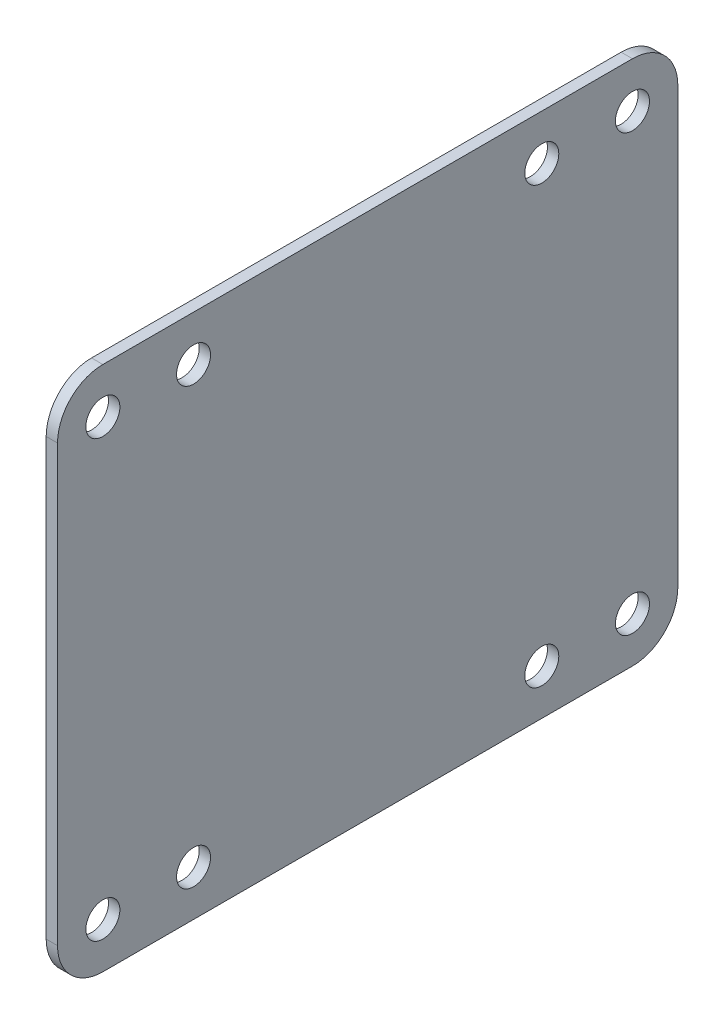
ISO-10303-21;
HEADER;
FILE_DESCRIPTION(('STEP AP214'),'2;1');
FILE_NAME('part.step','',(''),(''),'','','');
FILE_SCHEMA(('AUTOMOTIVE_DESIGN { 1 0 10303 214 1 1 1 1 }'));
ENDSEC;
DATA;
#1=APPLICATION_CONTEXT('core data for automotive mechanical design processes');
#2=APPLICATION_PROTOCOL_DEFINITION('international standard','automotive_design',2000,#1);
#3=PRODUCT_CONTEXT('',#1,'mechanical');
#4=PRODUCT('Part','Part','',(#3));
#5=PRODUCT_RELATED_PRODUCT_CATEGORY('part','',(#4));
#6=PRODUCT_DEFINITION_FORMATION('','',#4);
#7=PRODUCT_DEFINITION_CONTEXT('part definition',#1,'design');
#8=PRODUCT_DEFINITION('design','',#6,#7);
#9=PRODUCT_DEFINITION_SHAPE('','',#8);
#10=(LENGTH_UNIT() NAMED_UNIT(*) SI_UNIT(.MILLI.,.METRE.));
#11=(NAMED_UNIT(*) PLANE_ANGLE_UNIT() SI_UNIT($,.RADIAN.));
#12=(NAMED_UNIT(*) SI_UNIT($,.STERADIAN.) SOLID_ANGLE_UNIT());
#13=UNCERTAINTY_MEASURE_WITH_UNIT(LENGTH_MEASURE(1.E-05),#10,'distance_accuracy_value','');
#14=(GEOMETRIC_REPRESENTATION_CONTEXT(3) GLOBAL_UNCERTAINTY_ASSIGNED_CONTEXT((#13)) GLOBAL_UNIT_ASSIGNED_CONTEXT((#10,
#11,#12)) REPRESENTATION_CONTEXT('',''));
#15=CARTESIAN_POINT('',(0.,0.,0.));
#16=DIRECTION('',(0.,0.,1.));
#17=DIRECTION('',(1.,0.,0.));
#18=AXIS2_PLACEMENT_3D('',#15,#16,#17);
#19=CARTESIAN_POINT('',(1.5875,0.,0.));
#20=DIRECTION('',(1.,0.,0.));
#21=DIRECTION('',(0.,0.,-1.));
#22=AXIS2_PLACEMENT_3D('',#19,#20,#21);
#23=PLANE('',#22);
#24=CARTESIAN_POINT('',(1.5875,-60.96,-61.468));
#25=DIRECTION('',(1.,0.,0.));
#26=DIRECTION('',(0.,0.,-1.));
#27=AXIS2_PLACEMENT_3D('',#24,#25,#26);
#28=CIRCLE('',#27,2.38125000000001);
#29=CARTESIAN_POINT('',(1.5875,-60.96,-63.84925));
#30=VERTEX_POINT('',#29);
#31=EDGE_CURVE('E209',#30,#30,#28,.T.);
#32=ORIENTED_EDGE('',*,*,#31,.F.);
#33=EDGE_LOOP('',(#32));
#34=FACE_BOUND('',#33,.T.);
#35=CARTESIAN_POINT('',(1.5875,0.,12.7));
#36=DIRECTION('',(1.,0.,0.));
#37=DIRECTION('',(0.,0.,-1.));
#38=AXIS2_PLACEMENT_3D('',#35,#36,#37);
#39=CIRCLE('',#38,2.38125);
#40=CARTESIAN_POINT('',(1.5875,0.,10.31875));
#41=VERTEX_POINT('',#40);
#42=EDGE_CURVE('E197',#41,#41,#39,.T.);
#43=ORIENTED_EDGE('',*,*,#42,.F.);
#44=EDGE_LOOP('',(#43));
#45=FACE_BOUND('',#44,.T.);
#46=CARTESIAN_POINT('',(1.5875,-60.96,-48.768));
#47=DIRECTION('',(1.,0.,0.));
#48=DIRECTION('',(0.,0.,-1.));
#49=AXIS2_PLACEMENT_3D('',#46,#47,#48);
#50=CIRCLE('',#49,2.38125);
#51=CARTESIAN_POINT('',(1.5875,-60.96,-51.14925));
#52=VERTEX_POINT('',#51);
#53=EDGE_CURVE('E185',#52,#52,#50,.T.);
#54=ORIENTED_EDGE('',*,*,#53,.F.);
#55=EDGE_LOOP('',(#54));
#56=FACE_BOUND('',#55,.T.);
#57=CARTESIAN_POINT('',(1.5875,0.,0.));
#58=DIRECTION('',(1.,0.,0.));
#59=DIRECTION('',(0.,0.,-1.));
#60=AXIS2_PLACEMENT_3D('',#57,#58,#59);
#61=CIRCLE('',#60,2.38125);
#62=CARTESIAN_POINT('',(1.5875,0.,-2.38125));
#63=VERTEX_POINT('',#62);
#64=EDGE_CURVE('E131',#63,#63,#61,.T.);
#65=ORIENTED_EDGE('',*,*,#64,.F.);
#66=EDGE_LOOP('',(#65));
#67=FACE_BOUND('',#66,.T.);
#68=DIRECTION('',(0.,-1.,0.));
#69=VECTOR('',#68,1.);
#70=CARTESIAN_POINT('',(1.5875,6.35,19.05));
#71=LINE('',#70,#69);
#72=CARTESIAN_POINT('',(1.5875,0.,19.05));
#73=VERTEX_POINT('',#72);
#74=CARTESIAN_POINT('',(1.5875,-60.96,19.05));
#75=VERTEX_POINT('',#74);
#76=EDGE_CURVE('E136',#73,#75,#71,.T.);
#77=ORIENTED_EDGE('',*,*,#76,.T.);
#78=CARTESIAN_POINT('',(1.5875,-60.96,12.7));
#79=DIRECTION('',(1.,0.,0.));
#80=DIRECTION('',(0.,0.,-1.));
#81=AXIS2_PLACEMENT_3D('',#78,#79,#80);
#82=CIRCLE('',#81,6.35);
#83=CARTESIAN_POINT('',(1.5875,-67.31,12.7));
#84=VERTEX_POINT('',#83);
#85=EDGE_CURVE('E151',#75,#84,#82,.T.);
#86=ORIENTED_EDGE('',*,*,#85,.T.);
#87=DIRECTION('',(0.,0.,-1.));
#88=VECTOR('',#87,1.);
#89=CARTESIAN_POINT('',(1.5875,-67.31,19.05));
#90=LINE('',#89,#88);
#91=CARTESIAN_POINT('',(1.5875,-67.31,-61.468));
#92=VERTEX_POINT('',#91);
#93=EDGE_CURVE('E118',#84,#92,#90,.T.);
#94=ORIENTED_EDGE('',*,*,#93,.T.);
#95=CARTESIAN_POINT('',(1.5875,-60.96,-61.468));
#96=DIRECTION('',(1.,0.,0.));
#97=DIRECTION('',(0.,0.,-1.));
#98=AXIS2_PLACEMENT_3D('',#95,#96,#97);
#99=CIRCLE('',#98,6.35);
#100=CARTESIAN_POINT('',(1.5875,-60.96,-67.818));
#101=VERTEX_POINT('',#100);
#102=EDGE_CURVE('E149',#92,#101,#99,.T.);
#103=ORIENTED_EDGE('',*,*,#102,.T.);
#104=DIRECTION('',(0.,1.,0.));
#105=VECTOR('',#104,1.);
#106=CARTESIAN_POINT('',(1.5875,6.35,-67.818));
#107=LINE('',#106,#105);
#108=CARTESIAN_POINT('',(1.5875,0.,-67.818));
#109=VERTEX_POINT('',#108);
#110=EDGE_CURVE('E162',#101,#109,#107,.T.);
#111=ORIENTED_EDGE('',*,*,#110,.T.);
#112=CARTESIAN_POINT('',(1.5875,0.,-61.468));
#113=DIRECTION('',(1.,0.,0.));
#114=DIRECTION('',(0.,0.,-1.));
#115=AXIS2_PLACEMENT_3D('',#112,#113,#114);
#116=CIRCLE('',#115,6.35);
#117=CARTESIAN_POINT('',(1.5875,6.35,-61.468));
#118=VERTEX_POINT('',#117);
#119=EDGE_CURVE('E53',#109,#118,#116,.T.);
#120=ORIENTED_EDGE('',*,*,#119,.T.);
#121=DIRECTION('',(0.,0.,1.));
#122=VECTOR('',#121,1.);
#123=CARTESIAN_POINT('',(1.5875,6.35,19.05));
#124=LINE('',#123,#122);
#125=CARTESIAN_POINT('',(1.5875,6.35,12.7));
#126=VERTEX_POINT('',#125);
#127=EDGE_CURVE('E137',#118,#126,#124,.T.);
#128=ORIENTED_EDGE('',*,*,#127,.T.);
#129=CARTESIAN_POINT('',(1.5875,0.,12.7));
#130=DIRECTION('',(1.,0.,0.));
#131=DIRECTION('',(0.,0.,-1.));
#132=AXIS2_PLACEMENT_3D('',#129,#130,#131);
#133=CIRCLE('',#132,6.35);
#134=EDGE_CURVE('E146',#126,#73,#133,.T.);
#135=ORIENTED_EDGE('',*,*,#134,.T.);
#136=EDGE_LOOP('',(#77,#86,#94,#103,#111,#120,#128,#135));
#137=FACE_BOUND('',#136,.T.);
#138=CARTESIAN_POINT('',(1.5875,0.,-48.768));
#139=DIRECTION('',(1.,0.,0.));
#140=DIRECTION('',(0.,0.,-1.));
#141=AXIS2_PLACEMENT_3D('',#138,#139,#140);
#142=CIRCLE('',#141,2.38125);
#143=CARTESIAN_POINT('',(1.5875,0.,-51.14925));
#144=VERTEX_POINT('',#143);
#145=EDGE_CURVE('E179',#144,#144,#142,.T.);
#146=ORIENTED_EDGE('',*,*,#145,.F.);
#147=EDGE_LOOP('',(#146));
#148=FACE_BOUND('',#147,.T.);
#149=CARTESIAN_POINT('',(1.5875,-60.96,0.));
#150=DIRECTION('',(1.,0.,0.));
#151=DIRECTION('',(0.,0.,-1.));
#152=AXIS2_PLACEMENT_3D('',#149,#150,#151);
#153=CIRCLE('',#152,2.38125);
#154=CARTESIAN_POINT('',(1.5875,-60.96,-2.38125000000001));
#155=VERTEX_POINT('',#154);
#156=EDGE_CURVE('E191',#155,#155,#153,.T.);
#157=ORIENTED_EDGE('',*,*,#156,.F.);
#158=EDGE_LOOP('',(#157));
#159=FACE_BOUND('',#158,.T.);
#160=CARTESIAN_POINT('',(1.5875,0.,-61.468));
#161=DIRECTION('',(1.,0.,0.));
#162=DIRECTION('',(0.,0.,-1.));
#163=AXIS2_PLACEMENT_3D('',#160,#161,#162);
#164=CIRCLE('',#163,2.38125);
#165=CARTESIAN_POINT('',(1.5875,0.,-63.84925));
#166=VERTEX_POINT('',#165);
#167=EDGE_CURVE('E203',#166,#166,#164,.T.);
#168=ORIENTED_EDGE('',*,*,#167,.F.);
#169=EDGE_LOOP('',(#168));
#170=FACE_BOUND('',#169,.T.);
#171=CARTESIAN_POINT('',(1.5875,-60.96,12.7));
#172=DIRECTION('',(1.,0.,0.));
#173=DIRECTION('',(0.,0.,-1.));
#174=AXIS2_PLACEMENT_3D('',#171,#172,#173);
#175=CIRCLE('',#174,2.38125);
#176=CARTESIAN_POINT('',(1.5875,-60.96,10.31875));
#177=VERTEX_POINT('',#176);
#178=EDGE_CURVE('E215',#177,#177,#175,.T.);
#179=ORIENTED_EDGE('',*,*,#178,.F.);
#180=EDGE_LOOP('',(#179));
#181=FACE_BOUND('',#180,.T.);
#182=ADVANCED_FACE('F32',(#34,#45,#56,#67,#137,#148,#159,#170,#181),#23,.T.);
#183=CARTESIAN_POINT('',(0.,0.,0.));
#184=DIRECTION('',(1.,0.,0.));
#185=DIRECTION('',(0.,0.,-1.));
#186=AXIS2_PLACEMENT_3D('',#183,#184,#185);
#187=PLANE('',#186);
#188=DIRECTION('',(0.,0.,-1.));
#189=VECTOR('',#188,1.);
#190=CARTESIAN_POINT('',(0.,-67.31,19.05));
#191=LINE('',#190,#189);
#192=CARTESIAN_POINT('',(0.,-67.31,12.7));
#193=VERTEX_POINT('',#192);
#194=CARTESIAN_POINT('',(0.,-67.31,-61.468));
#195=VERTEX_POINT('',#194);
#196=EDGE_CURVE('E115',#193,#195,#191,.T.);
#197=ORIENTED_EDGE('',*,*,#196,.F.);
#198=CARTESIAN_POINT('',(0.,-60.96,12.7));
#199=DIRECTION('',(1.,0.,0.));
#200=DIRECTION('',(0.,0.,-1.));
#201=AXIS2_PLACEMENT_3D('',#198,#199,#200);
#202=CIRCLE('',#201,6.35);
#203=CARTESIAN_POINT('',(0.,-60.96,19.05));
#204=VERTEX_POINT('',#203);
#205=EDGE_CURVE('E98',#193,#204,#202,.F.);
#206=ORIENTED_EDGE('',*,*,#205,.T.);
#207=DIRECTION('',(0.,-1.,0.));
#208=VECTOR('',#207,1.);
#209=CARTESIAN_POINT('',(0.,6.35,19.05));
#210=LINE('',#209,#208);
#211=CARTESIAN_POINT('',(0.,0.,19.05));
#212=VERTEX_POINT('',#211);
#213=EDGE_CURVE('E126',#212,#204,#210,.T.);
#214=ORIENTED_EDGE('',*,*,#213,.F.);
#215=CARTESIAN_POINT('',(0.,0.,12.7));
#216=DIRECTION('',(1.,0.,0.));
#217=DIRECTION('',(0.,0.,-1.));
#218=AXIS2_PLACEMENT_3D('',#215,#216,#217);
#219=CIRCLE('',#218,6.35);
#220=CARTESIAN_POINT('',(0.,6.35,12.7));
#221=VERTEX_POINT('',#220);
#222=EDGE_CURVE('E119',#212,#221,#219,.F.);
#223=ORIENTED_EDGE('',*,*,#222,.T.);
#224=DIRECTION('',(0.,0.,1.));
#225=VECTOR('',#224,1.);
#226=CARTESIAN_POINT('',(0.,6.35,19.05));
#227=LINE('',#226,#225);
#228=CARTESIAN_POINT('',(0.,6.35,-61.468));
#229=VERTEX_POINT('',#228);
#230=EDGE_CURVE('E129',#229,#221,#227,.T.);
#231=ORIENTED_EDGE('',*,*,#230,.F.);
#232=CARTESIAN_POINT('',(0.,0.,-61.468));
#233=DIRECTION('',(1.,0.,0.));
#234=DIRECTION('',(0.,0.,-1.));
#235=AXIS2_PLACEMENT_3D('',#232,#233,#234);
#236=CIRCLE('',#235,6.35);
#237=CARTESIAN_POINT('',(0.,0.,-67.818));
#238=VERTEX_POINT('',#237);
#239=EDGE_CURVE('E140',#229,#238,#236,.F.);
#240=ORIENTED_EDGE('',*,*,#239,.T.);
#241=DIRECTION('',(0.,1.,0.));
#242=VECTOR('',#241,1.);
#243=CARTESIAN_POINT('',(0.,6.35,-67.818));
#244=LINE('',#243,#242);
#245=CARTESIAN_POINT('',(0.,-60.96,-67.818));
#246=VERTEX_POINT('',#245);
#247=EDGE_CURVE('E125',#246,#238,#244,.T.);
#248=ORIENTED_EDGE('',*,*,#247,.F.);
#249=CARTESIAN_POINT('',(0.,-60.96,-61.468));
#250=DIRECTION('',(1.,0.,0.));
#251=DIRECTION('',(0.,0.,-1.));
#252=AXIS2_PLACEMENT_3D('',#249,#250,#251);
#253=CIRCLE('',#252,6.35);
#254=EDGE_CURVE('E109',#246,#195,#253,.F.);
#255=ORIENTED_EDGE('',*,*,#254,.T.);
#256=EDGE_LOOP('',(#197,#206,#214,#223,#231,#240,#248,#255));
#257=FACE_BOUND('',#256,.T.);
#258=CARTESIAN_POINT('',(0.,0.,0.));
#259=DIRECTION('',(1.,0.,0.));
#260=DIRECTION('',(0.,0.,-1.));
#261=AXIS2_PLACEMENT_3D('',#258,#259,#260);
#262=CIRCLE('',#261,2.38125);
#263=CARTESIAN_POINT('',(0.,0.,-2.38125));
#264=VERTEX_POINT('',#263);
#265=EDGE_CURVE('E176',#264,#264,#262,.T.);
#266=ORIENTED_EDGE('',*,*,#265,.T.);
#267=EDGE_LOOP('',(#266));
#268=FACE_BOUND('',#267,.T.);
#269=CARTESIAN_POINT('',(0.,0.,-48.768));
#270=DIRECTION('',(1.,0.,0.));
#271=DIRECTION('',(0.,0.,-1.));
#272=AXIS2_PLACEMENT_3D('',#269,#270,#271);
#273=CIRCLE('',#272,2.38125);
#274=CARTESIAN_POINT('',(0.,0.,-51.14925));
#275=VERTEX_POINT('',#274);
#276=EDGE_CURVE('E182',#275,#275,#273,.T.);
#277=ORIENTED_EDGE('',*,*,#276,.T.);
#278=EDGE_LOOP('',(#277));
#279=FACE_BOUND('',#278,.T.);
#280=CARTESIAN_POINT('',(0.,-60.96,-48.768));
#281=DIRECTION('',(1.,0.,0.));
#282=DIRECTION('',(0.,0.,-1.));
#283=AXIS2_PLACEMENT_3D('',#280,#281,#282);
#284=CIRCLE('',#283,2.38125);
#285=CARTESIAN_POINT('',(0.,-60.96,-51.14925));
#286=VERTEX_POINT('',#285);
#287=EDGE_CURVE('E188',#286,#286,#284,.T.);
#288=ORIENTED_EDGE('',*,*,#287,.T.);
#289=EDGE_LOOP('',(#288));
#290=FACE_BOUND('',#289,.T.);
#291=CARTESIAN_POINT('',(0.,-60.96,0.));
#292=DIRECTION('',(1.,0.,0.));
#293=DIRECTION('',(0.,0.,-1.));
#294=AXIS2_PLACEMENT_3D('',#291,#292,#293);
#295=CIRCLE('',#294,2.38125);
#296=CARTESIAN_POINT('',(0.,-60.96,-2.38125000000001));
#297=VERTEX_POINT('',#296);
#298=EDGE_CURVE('E194',#297,#297,#295,.T.);
#299=ORIENTED_EDGE('',*,*,#298,.T.);
#300=EDGE_LOOP('',(#299));
#301=FACE_BOUND('',#300,.T.);
#302=CARTESIAN_POINT('',(0.,0.,12.7));
#303=DIRECTION('',(1.,0.,0.));
#304=DIRECTION('',(0.,0.,-1.));
#305=AXIS2_PLACEMENT_3D('',#302,#303,#304);
#306=CIRCLE('',#305,2.38125);
#307=CARTESIAN_POINT('',(0.,0.,10.31875));
#308=VERTEX_POINT('',#307);
#309=EDGE_CURVE('E200',#308,#308,#306,.T.);
#310=ORIENTED_EDGE('',*,*,#309,.T.);
#311=EDGE_LOOP('',(#310));
#312=FACE_BOUND('',#311,.T.);
#313=CARTESIAN_POINT('',(0.,0.,-61.468));
#314=DIRECTION('',(1.,0.,0.));
#315=DIRECTION('',(0.,0.,-1.));
#316=AXIS2_PLACEMENT_3D('',#313,#314,#315);
#317=CIRCLE('',#316,2.38125);
#318=CARTESIAN_POINT('',(0.,0.,-63.84925));
#319=VERTEX_POINT('',#318);
#320=EDGE_CURVE('E206',#319,#319,#317,.T.);
#321=ORIENTED_EDGE('',*,*,#320,.T.);
#322=EDGE_LOOP('',(#321));
#323=FACE_BOUND('',#322,.T.);
#324=CARTESIAN_POINT('',(0.,-60.96,-61.468));
#325=DIRECTION('',(1.,0.,0.));
#326=DIRECTION('',(0.,0.,-1.));
#327=AXIS2_PLACEMENT_3D('',#324,#325,#326);
#328=CIRCLE('',#327,2.38125000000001);
#329=CARTESIAN_POINT('',(0.,-60.96,-63.84925));
#330=VERTEX_POINT('',#329);
#331=EDGE_CURVE('E212',#330,#330,#328,.T.);
#332=ORIENTED_EDGE('',*,*,#331,.T.);
#333=EDGE_LOOP('',(#332));
#334=FACE_BOUND('',#333,.T.);
#335=CARTESIAN_POINT('',(0.,-60.96,12.7));
#336=DIRECTION('',(1.,0.,0.));
#337=DIRECTION('',(0.,0.,-1.));
#338=AXIS2_PLACEMENT_3D('',#335,#336,#337);
#339=CIRCLE('',#338,2.38125);
#340=CARTESIAN_POINT('',(0.,-60.96,10.31875));
#341=VERTEX_POINT('',#340);
#342=EDGE_CURVE('E218',#341,#341,#339,.T.);
#343=ORIENTED_EDGE('',*,*,#342,.T.);
#344=EDGE_LOOP('',(#343));
#345=FACE_BOUND('',#344,.T.);
#346=ADVANCED_FACE('F122',(#257,#268,#279,#290,#301,#312,#323,#334,#345),#187,.F.);
#347=CARTESIAN_POINT('',(1.5875,6.35,19.05));
#348=DIRECTION('',(0.,0.,-1.));
#349=DIRECTION('',(0.,1.,0.));
#350=AXIS2_PLACEMENT_3D('',#347,#348,#349);
#351=PLANE('',#350);
#352=ORIENTED_EDGE('',*,*,#213,.T.);
#353=DIRECTION('',(-1.,0.,0.));
#354=VECTOR('',#353,1.);
#355=CARTESIAN_POINT('',(1.5875,-60.96,19.05));
#356=LINE('',#355,#354);
#357=EDGE_CURVE('E103',#204,#75,#356,.F.);
#358=ORIENTED_EDGE('',*,*,#357,.T.);
#359=ORIENTED_EDGE('',*,*,#76,.F.);
#360=DIRECTION('',(-1.,0.,0.));
#361=VECTOR('',#360,1.);
#362=CARTESIAN_POINT('',(1.5875,0.,19.05));
#363=LINE('',#362,#361);
#364=EDGE_CURVE('E108',#73,#212,#363,.T.);
#365=ORIENTED_EDGE('',*,*,#364,.T.);
#366=EDGE_LOOP('',(#352,#358,#359,#365));
#367=FACE_BOUND('',#366,.T.);
#368=ADVANCED_FACE('F233',(#367),#351,.F.);
#369=CARTESIAN_POINT('',(1.5875,-67.31,19.05));
#370=DIRECTION('',(0.,1.,0.));
#371=DIRECTION('',(0.,0.,1.));
#372=AXIS2_PLACEMENT_3D('',#369,#370,#371);
#373=PLANE('',#372);
#374=ORIENTED_EDGE('',*,*,#93,.F.);
#375=DIRECTION('',(-1.,0.,0.));
#376=VECTOR('',#375,1.);
#377=CARTESIAN_POINT('',(1.5875,-67.31,12.7));
#378=LINE('',#377,#376);
#379=EDGE_CURVE('E102',#84,#193,#378,.T.);
#380=ORIENTED_EDGE('',*,*,#379,.T.);
#381=ORIENTED_EDGE('',*,*,#196,.T.);
#382=DIRECTION('',(-1.,0.,0.));
#383=VECTOR('',#382,1.);
#384=CARTESIAN_POINT('',(1.5875,-67.31,-61.468));
#385=LINE('',#384,#383);
#386=EDGE_CURVE('E120',#195,#92,#385,.F.);
#387=ORIENTED_EDGE('',*,*,#386,.T.);
#388=EDGE_LOOP('',(#374,#380,#381,#387));
#389=FACE_BOUND('',#388,.T.);
#390=ADVANCED_FACE('F114',(#389),#373,.F.);
#391=CARTESIAN_POINT('',(1.5875,6.35,-67.818));
#392=DIRECTION('',(0.,0.,1.));
#393=DIRECTION('',(0.,-1.,0.));
#394=AXIS2_PLACEMENT_3D('',#391,#392,#393);
#395=PLANE('',#394);
#396=ORIENTED_EDGE('',*,*,#110,.F.);
#397=DIRECTION('',(-1.,0.,0.));
#398=VECTOR('',#397,1.);
#399=CARTESIAN_POINT('',(1.5875,-60.96,-67.818));
#400=LINE('',#399,#398);
#401=EDGE_CURVE('E155',#101,#246,#400,.T.);
#402=ORIENTED_EDGE('',*,*,#401,.T.);
#403=ORIENTED_EDGE('',*,*,#247,.T.);
#404=DIRECTION('',(-1.,0.,0.));
#405=VECTOR('',#404,1.);
#406=CARTESIAN_POINT('',(1.5875,0.,-67.818));
#407=LINE('',#406,#405);
#408=EDGE_CURVE('E153',#238,#109,#407,.F.);
#409=ORIENTED_EDGE('',*,*,#408,.T.);
#410=EDGE_LOOP('',(#396,#402,#403,#409));
#411=FACE_BOUND('',#410,.T.);
#412=ADVANCED_FACE('F160',(#411),#395,.F.);
#413=CARTESIAN_POINT('',(1.5875,6.35,19.05));
#414=DIRECTION('',(0.,-1.,0.));
#415=DIRECTION('',(0.,0.,-1.));
#416=AXIS2_PLACEMENT_3D('',#413,#414,#415);
#417=PLANE('',#416);
#418=ORIENTED_EDGE('',*,*,#127,.F.);
#419=DIRECTION('',(-1.,0.,0.));
#420=VECTOR('',#419,1.);
#421=CARTESIAN_POINT('',(1.5875,6.35,-61.468));
#422=LINE('',#421,#420);
#423=EDGE_CURVE('E11',#118,#229,#422,.T.);
#424=ORIENTED_EDGE('',*,*,#423,.T.);
#425=ORIENTED_EDGE('',*,*,#230,.T.);
#426=DIRECTION('',(-1.,0.,0.));
#427=VECTOR('',#426,1.);
#428=CARTESIAN_POINT('',(1.5875,6.35,12.7));
#429=LINE('',#428,#427);
#430=EDGE_CURVE('E40',#221,#126,#429,.F.);
#431=ORIENTED_EDGE('',*,*,#430,.T.);
#432=EDGE_LOOP('',(#418,#424,#425,#431));
#433=FACE_BOUND('',#432,.T.);
#434=ADVANCED_FACE('F169',(#433),#417,.F.);
#435=CARTESIAN_POINT('',(1.5875,0.,0.));
#436=DIRECTION('',(-1.,0.,0.));
#437=DIRECTION('',(0.,0.,1.));
#438=AXIS2_PLACEMENT_3D('',#435,#436,#437);
#439=CYLINDRICAL_SURFACE('',#438,2.38125);
#440=ORIENTED_EDGE('',*,*,#64,.T.);
#441=EDGE_LOOP('',(#440));
#442=FACE_BOUND('',#441,.T.);
#443=ORIENTED_EDGE('',*,*,#265,.F.);
#444=EDGE_LOOP('',(#443));
#445=FACE_BOUND('',#444,.T.);
#446=ADVANCED_FACE('F238',(#442,#445),#439,.F.);
#447=CARTESIAN_POINT('',(1.5875,0.,-48.768));
#448=DIRECTION('',(-1.,0.,0.));
#449=DIRECTION('',(0.,0.,1.));
#450=AXIS2_PLACEMENT_3D('',#447,#448,#449);
#451=CYLINDRICAL_SURFACE('',#450,2.38125);
#452=ORIENTED_EDGE('',*,*,#145,.T.);
#453=EDGE_LOOP('',(#452));
#454=FACE_BOUND('',#453,.T.);
#455=ORIENTED_EDGE('',*,*,#276,.F.);
#456=EDGE_LOOP('',(#455));
#457=FACE_BOUND('',#456,.T.);
#458=ADVANCED_FACE('F299',(#454,#457),#451,.F.);
#459=CARTESIAN_POINT('',(1.5875,-60.96,-48.768));
#460=DIRECTION('',(-1.,0.,0.));
#461=DIRECTION('',(0.,0.,1.));
#462=AXIS2_PLACEMENT_3D('',#459,#460,#461);
#463=CYLINDRICAL_SURFACE('',#462,2.38125);
#464=ORIENTED_EDGE('',*,*,#53,.T.);
#465=EDGE_LOOP('',(#464));
#466=FACE_BOUND('',#465,.T.);
#467=ORIENTED_EDGE('',*,*,#287,.F.);
#468=EDGE_LOOP('',(#467));
#469=FACE_BOUND('',#468,.T.);
#470=ADVANCED_FACE('F296',(#466,#469),#463,.F.);
#471=CARTESIAN_POINT('',(1.5875,-60.96,0.));
#472=DIRECTION('',(-1.,0.,0.));
#473=DIRECTION('',(0.,0.,1.));
#474=AXIS2_PLACEMENT_3D('',#471,#472,#473);
#475=CYLINDRICAL_SURFACE('',#474,2.38125);
#476=ORIENTED_EDGE('',*,*,#156,.T.);
#477=EDGE_LOOP('',(#476));
#478=FACE_BOUND('',#477,.T.);
#479=ORIENTED_EDGE('',*,*,#298,.F.);
#480=EDGE_LOOP('',(#479));
#481=FACE_BOUND('',#480,.T.);
#482=ADVANCED_FACE('F292',(#478,#481),#475,.F.);
#483=CARTESIAN_POINT('',(1.5875,0.,12.7));
#484=DIRECTION('',(-1.,0.,0.));
#485=DIRECTION('',(0.,0.,1.));
#486=AXIS2_PLACEMENT_3D('',#483,#484,#485);
#487=CYLINDRICAL_SURFACE('',#486,2.38125);
#488=ORIENTED_EDGE('',*,*,#42,.T.);
#489=EDGE_LOOP('',(#488));
#490=FACE_BOUND('',#489,.T.);
#491=ORIENTED_EDGE('',*,*,#309,.F.);
#492=EDGE_LOOP('',(#491));
#493=FACE_BOUND('',#492,.T.);
#494=ADVANCED_FACE('F274',(#490,#493),#487,.F.);
#495=CARTESIAN_POINT('',(1.5875,0.,-61.468));
#496=DIRECTION('',(-1.,0.,0.));
#497=DIRECTION('',(0.,0.,1.));
#498=AXIS2_PLACEMENT_3D('',#495,#496,#497);
#499=CYLINDRICAL_SURFACE('',#498,2.38125);
#500=ORIENTED_EDGE('',*,*,#167,.T.);
#501=EDGE_LOOP('',(#500));
#502=FACE_BOUND('',#501,.T.);
#503=ORIENTED_EDGE('',*,*,#320,.F.);
#504=EDGE_LOOP('',(#503));
#505=FACE_BOUND('',#504,.T.);
#506=ADVANCED_FACE('F270',(#502,#505),#499,.F.);
#507=CARTESIAN_POINT('',(1.5875,-60.96,-61.468));
#508=DIRECTION('',(-1.,0.,0.));
#509=DIRECTION('',(0.,0.,1.));
#510=AXIS2_PLACEMENT_3D('',#507,#508,#509);
#511=CYLINDRICAL_SURFACE('',#510,2.38125000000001);
#512=ORIENTED_EDGE('',*,*,#31,.T.);
#513=EDGE_LOOP('',(#512));
#514=FACE_BOUND('',#513,.T.);
#515=ORIENTED_EDGE('',*,*,#331,.F.);
#516=EDGE_LOOP('',(#515));
#517=FACE_BOUND('',#516,.T.);
#518=ADVANCED_FACE('F273',(#514,#517),#511,.F.);
#519=CARTESIAN_POINT('',(1.5875,-60.96,12.7));
#520=DIRECTION('',(-1.,0.,0.));
#521=DIRECTION('',(0.,0.,1.));
#522=AXIS2_PLACEMENT_3D('',#519,#520,#521);
#523=CYLINDRICAL_SURFACE('',#522,2.38125);
#524=ORIENTED_EDGE('',*,*,#178,.T.);
#525=EDGE_LOOP('',(#524));
#526=FACE_BOUND('',#525,.T.);
#527=ORIENTED_EDGE('',*,*,#342,.F.);
#528=EDGE_LOOP('',(#527));
#529=FACE_BOUND('',#528,.T.);
#530=ADVANCED_FACE('F224',(#526,#529),#523,.F.);
#531=CARTESIAN_POINT('',(1.5875,-60.96,12.7));
#532=DIRECTION('',(-1.,0.,0.));
#533=DIRECTION('',(0.,0.,1.));
#534=AXIS2_PLACEMENT_3D('',#531,#532,#533);
#535=CYLINDRICAL_SURFACE('',#534,6.35);
#536=ORIENTED_EDGE('',*,*,#85,.F.);
#537=ORIENTED_EDGE('',*,*,#357,.F.);
#538=ORIENTED_EDGE('',*,*,#205,.F.);
#539=ORIENTED_EDGE('',*,*,#379,.F.);
#540=EDGE_LOOP('',(#536,#537,#538,#539));
#541=FACE_BOUND('',#540,.T.);
#542=ADVANCED_FACE('F101',(#541),#535,.T.);
#543=CARTESIAN_POINT('',(1.5875,-60.96,-61.468));
#544=DIRECTION('',(-1.,0.,0.));
#545=DIRECTION('',(0.,0.,1.));
#546=AXIS2_PLACEMENT_3D('',#543,#544,#545);
#547=CYLINDRICAL_SURFACE('',#546,6.35);
#548=ORIENTED_EDGE('',*,*,#102,.F.);
#549=ORIENTED_EDGE('',*,*,#386,.F.);
#550=ORIENTED_EDGE('',*,*,#254,.F.);
#551=ORIENTED_EDGE('',*,*,#401,.F.);
#552=EDGE_LOOP('',(#548,#549,#550,#551));
#553=FACE_BOUND('',#552,.T.);
#554=ADVANCED_FACE('F252',(#553),#547,.T.);
#555=CARTESIAN_POINT('',(1.5875,0.,-61.468));
#556=DIRECTION('',(-1.,0.,0.));
#557=DIRECTION('',(0.,0.,1.));
#558=AXIS2_PLACEMENT_3D('',#555,#556,#557);
#559=CYLINDRICAL_SURFACE('',#558,6.35);
#560=ORIENTED_EDGE('',*,*,#119,.F.);
#561=ORIENTED_EDGE('',*,*,#408,.F.);
#562=ORIENTED_EDGE('',*,*,#239,.F.);
#563=ORIENTED_EDGE('',*,*,#423,.F.);
#564=EDGE_LOOP('',(#560,#561,#562,#563));
#565=FACE_BOUND('',#564,.T.);
#566=ADVANCED_FACE('F168',(#565),#559,.T.);
#567=CARTESIAN_POINT('',(1.5875,0.,12.7));
#568=DIRECTION('',(-1.,0.,0.));
#569=DIRECTION('',(0.,0.,1.));
#570=AXIS2_PLACEMENT_3D('',#567,#568,#569);
#571=CYLINDRICAL_SURFACE('',#570,6.35);
#572=ORIENTED_EDGE('',*,*,#134,.F.);
#573=ORIENTED_EDGE('',*,*,#430,.F.);
#574=ORIENTED_EDGE('',*,*,#222,.F.);
#575=ORIENTED_EDGE('',*,*,#364,.F.);
#576=EDGE_LOOP('',(#572,#573,#574,#575));
#577=FACE_BOUND('',#576,.T.);
#578=ADVANCED_FACE('F34',(#577),#571,.T.);
#579=CLOSED_SHELL('',(#182,#346,#368,#390,#412,#434,#446,#458,#470,#482,#494,#506,#518,#530,
#542,#554,#566,#578));
#580=MANIFOLD_SOLID_BREP('B2',#579);
#581=ADVANCED_BREP_SHAPE_REPRESENTATION('',(#18,#580),#14);
#582=SHAPE_DEFINITION_REPRESENTATION(#9,#581);
ENDSEC;
END-ISO-10303-21;
